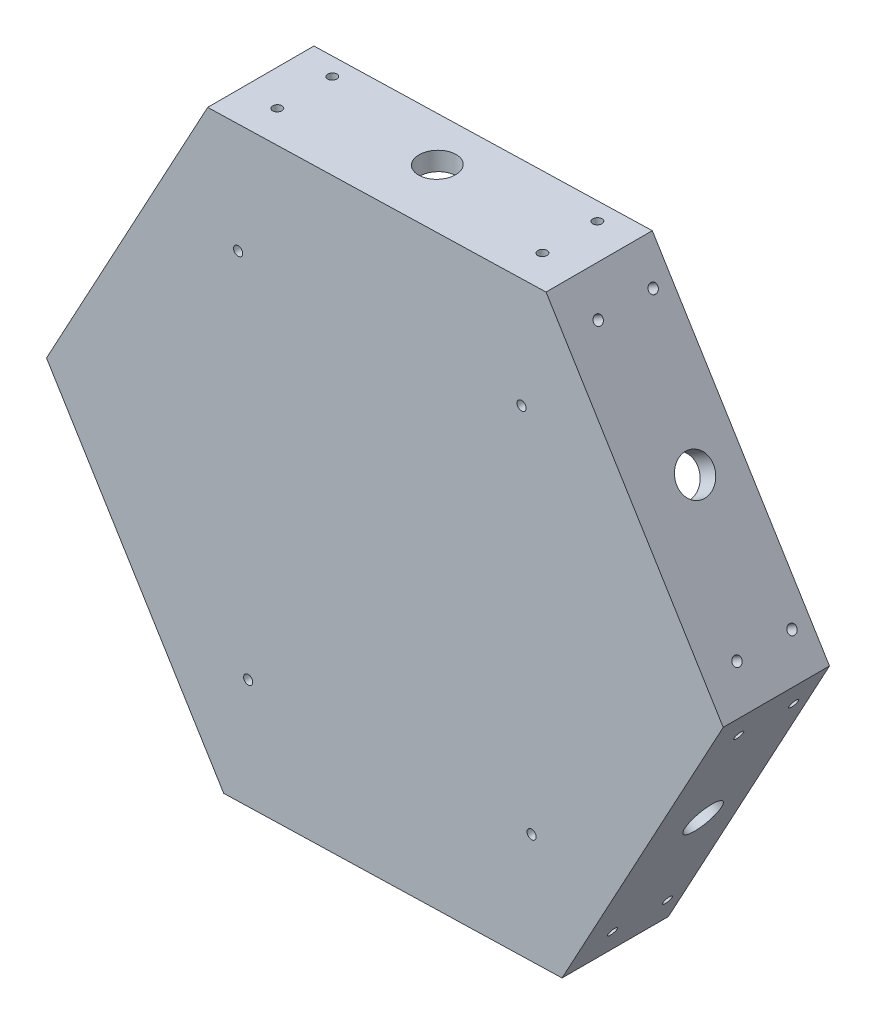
from build123d import *

# Parameters (mm, degrees)
BOSS_EXTRUDE1_DEPTH = 31.75
BOSS_EXTRUDE2_DEPTH = 5.08
SKETCH3_R           = 1.5875
SKETCH3_R_2         = 6.35
CUT_EXTRUDE1_DEPTH  = 241.168802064
SKETCH5_R           = 1.5875
SKETCH5_R_2         = 6.35
CUT_EXTRUDE2_DEPTH  = 260.524057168
SKETCH7_R           = 1.5875
SKETCH7_R_2         = 6.35
CUT_EXTRUDE3_DEPTH  = 259.86656026
CUT_EXTRUDE4_REACH  = 162.476
SKETCH13_R          = 1.5875
SKETCH15_R          = 22.225
BOSS_EXTRUDE3_DEPTH = 5.08


with BuildPart() as part:
    # Sketch2 → Boss-Extrude1 (new body)
    with BuildSketch(Plane.XY):
        Polygon((117.273806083, 3.20433147), (55.861870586, 103.164261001), (-61.411935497, 99.959929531), (-117.273806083, -3.20433147), (-55.861870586, -103.164261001), (61.411935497, -99.959929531), align=None)
        Polygon((52.370503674, 96.716494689), (-57.573689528, 93.712433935), (-109.944193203, -3.004060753), (-52.370503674, -96.716494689), (57.573689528, -93.712433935), (109.944193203, 3.004060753), align=None, mode=Mode.SUBTRACT)
    extrude(amount=BOSS_EXTRUDE1_DEPTH)

    # Sketch11 → Boss-Extrude2 (add)
    with BuildSketch(Plane.XY.offset(31.75)):
        Polygon((55.861870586, 103.164261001), (-61.411935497, 99.959929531), (-117.273806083, -3.20433147), (-55.861870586, -103.164261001), (61.411935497, -99.959929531), (117.273806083, 3.20433147), align=None)
    extrude(amount=BOSS_EXTRUDE2_DEPTH)

    # Sketch3 → Cut-Extrude1 (cut, through all)
    with BuildSketch(Plane(origin=(2.775032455, -101.562095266, 0), x_dir=(0.9996269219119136, 0.027313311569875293, 0), z_dir=(0.02731331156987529, -0.9996269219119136, 0))):
        with Locations((-45.95878735, 25.4)):
            Circle(SKETCH3_R)
        with Locations((-45.95878735, 6.35)):
            Circle(SKETCH3_R)
        with Locations((45.95878735, 25.4)):
            Circle(SKETCH3_R)
        with Locations((45.95878735, 6.35)):
            Circle(SKETCH3_R)
        with Locations((0, 15.875)):
            Circle(SKETCH3_R_2)
    extrude(amount=-CUT_EXTRUDE1_DEPTH, mode=Mode.SUBTRACT)

    # Sketch5 → Cut-Extrude2 (cut, through all)
    with BuildSketch(Plane(origin=(86.567838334, 53.184296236, 0), x_dir=(0, 0, -1), z_dir=(0.8520456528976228, 0.5234674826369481, 0))):
        with Locations(Location((-25.4, 45.95878735, 0), (0, 0, 90))):
            Circle(SKETCH5_R)
        with Locations(Location((-6.35, 45.95878735, 0), (0, 0, 90))):
            Circle(SKETCH5_R)
        with Locations(Location((-25.4, -45.95878735, 0), (0, 0, 90))):
            Circle(SKETCH5_R)
        with Locations(Location((-6.35, -45.95878735, 0), (0, 0, 90))):
            Circle(SKETCH5_R)
        with Locations(Location((-15.875, 0, 0), (0, 0, 90))):
            Circle(SKETCH5_R_2)
    extrude(amount=-CUT_EXTRUDE2_DEPTH, mode=Mode.SUBTRACT)

    # Sketch7 → Cut-Extrude3 (cut, through all)
    with BuildSketch(Plane(origin=(-89.34287079, 48.37779903, 0), x_dir=(0, 0, 1), z_dir=(-0.8793589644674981, 0.4761594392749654, 0))):
        with Locations(Location((6.35, 45.95878735, 0), (0, 0, 270))):
            Circle(SKETCH7_R)
        with Locations(Location((25.4, 45.95878735, 0), (0, 0, 270))):
            Circle(SKETCH7_R)
        with Locations(Location((6.35, -45.95878735, 0), (0, 0, 270))):
            Circle(SKETCH7_R)
        with Locations(Location((25.4, -45.95878735, 0), (0, 0, 270))):
            Circle(SKETCH7_R)
        with Locations(Location((15.875, 0, 0), (0, 0, 270))):
            Circle(SKETCH7_R_2)
    extrude(amount=-CUT_EXTRUDE3_DEPTH, mode=Mode.SUBTRACT)

    # Sketch13 → Cut-Extrude4 (cut, up to next)
    with BuildSketch(Plane.XY.offset(36.83), mode=Mode.PRIVATE) as cut_extrude4_sk1:
        with Locations((-50.849851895, 62.134303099)):
            Circle(SKETCH13_R)
    cut_extrude4_tool1 = extrude(cut_extrude4_sk1.sketch, amount=-CUT_EXTRUDE4_REACH, mode=Mode.PRIVATE) & part.part
    # Sketch13 → Cut-Extrude4 (cut, up to next)
    with BuildSketch(Plane.XY.offset(36.83), mode=Mode.PRIVATE) as cut_extrude4_sk2:
        with Locations((47.381061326, 64.818315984)):
            Circle(SKETCH13_R)
    cut_extrude4_tool2 = extrude(cut_extrude4_sk2.sketch, amount=-CUT_EXTRUDE4_REACH, mode=Mode.PRIVATE) & part.part
    # Sketch13 → Cut-Extrude4 (cut, up to next)
    with BuildSketch(Plane.XY.offset(36.83), mode=Mode.PRIVATE) as cut_extrude4_sk3:
        with Locations((-47.381061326, -64.818315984)):
            Circle(SKETCH13_R)
    cut_extrude4_tool3 = extrude(cut_extrude4_sk3.sketch, amount=-CUT_EXTRUDE4_REACH, mode=Mode.PRIVATE) & part.part
    # Sketch13 → Cut-Extrude4 (cut, up to next)
    with BuildSketch(Plane.XY.offset(36.83), mode=Mode.PRIVATE) as cut_extrude4_sk4:
        with Locations((50.849851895, -62.134303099)):
            Circle(SKETCH13_R)
    cut_extrude4_tool4 = extrude(cut_extrude4_sk4.sketch, amount=-CUT_EXTRUDE4_REACH, mode=Mode.PRIVATE) & part.part
    add(cut_extrude4_tool1.solids().sort_by_distance((-50.849852, 62.134303, 36.83))[0], mode=Mode.SUBTRACT)
    add(cut_extrude4_tool2.solids().sort_by_distance((47.381061, 64.818316, 36.83))[0], mode=Mode.SUBTRACT)
    add(cut_extrude4_tool3.solids().sort_by_distance((-47.381061, -64.818316, 36.83))[0], mode=Mode.SUBTRACT)
    add(cut_extrude4_tool4.solids().sort_by_distance((50.849852, -62.134303, 36.83))[0], mode=Mode.SUBTRACT)

    # Sketch15 → Boss-Extrude3 (add)
    with BuildSketch(Plane(origin=(0, 0, 31.75), x_dir=(-1, 0, 0), z_dir=(0, 0, -1))):
        with Locations(Location((0, 0, 0), (0, 0, 180))):
            Circle(SKETCH15_R)
    extrude(amount=BOSS_EXTRUDE3_DEPTH)


solid = part.part
